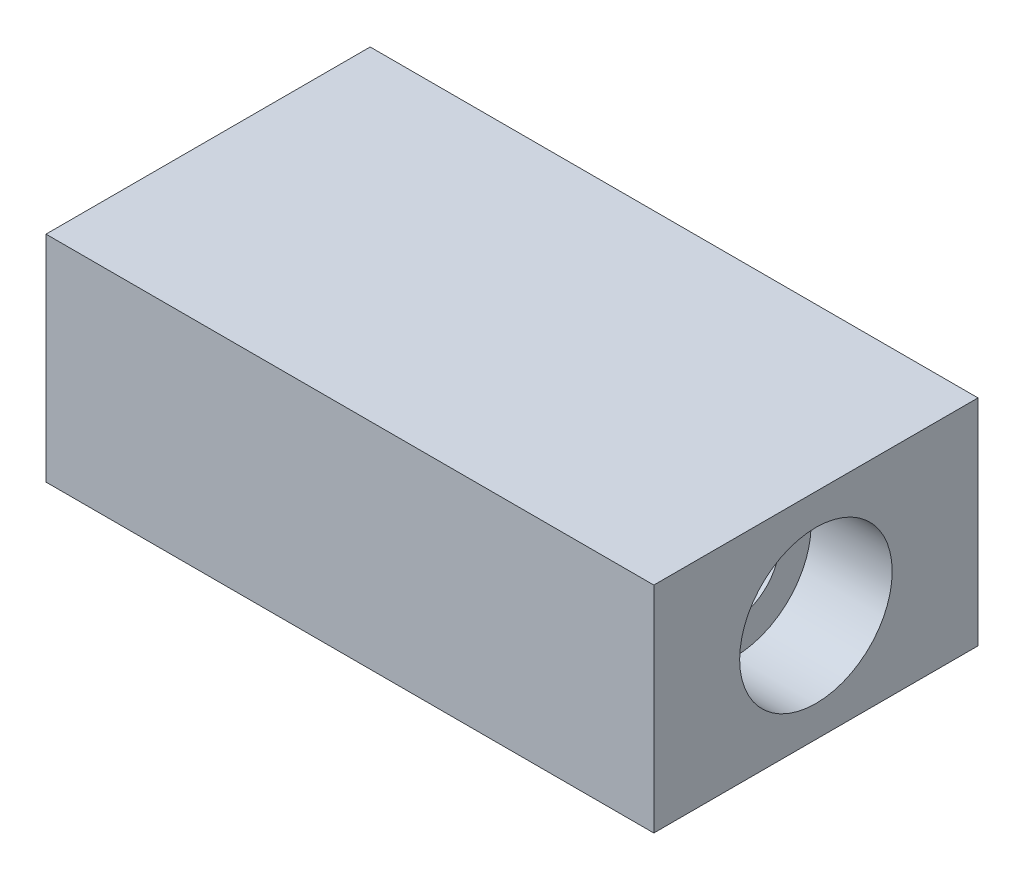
ISO-10303-21;
HEADER;
FILE_DESCRIPTION(('STEP AP214'),'2;1');
FILE_NAME('part.step','',(''),(''),'','','');
FILE_SCHEMA(('AUTOMOTIVE_DESIGN { 1 0 10303 214 1 1 1 1 }'));
ENDSEC;
DATA;
#1=APPLICATION_CONTEXT('core data for automotive mechanical design processes');
#2=APPLICATION_PROTOCOL_DEFINITION('international standard','automotive_design',2000,#1);
#3=PRODUCT_CONTEXT('',#1,'mechanical');
#4=PRODUCT('Part','Part','',(#3));
#5=PRODUCT_RELATED_PRODUCT_CATEGORY('part','',(#4));
#6=PRODUCT_DEFINITION_FORMATION('','',#4);
#7=PRODUCT_DEFINITION_CONTEXT('part definition',#1,'design');
#8=PRODUCT_DEFINITION('design','',#6,#7);
#9=PRODUCT_DEFINITION_SHAPE('','',#8);
#10=(LENGTH_UNIT() NAMED_UNIT(*) SI_UNIT(.MILLI.,.METRE.));
#11=(NAMED_UNIT(*) PLANE_ANGLE_UNIT() SI_UNIT($,.RADIAN.));
#12=(NAMED_UNIT(*) SI_UNIT($,.STERADIAN.) SOLID_ANGLE_UNIT());
#13=UNCERTAINTY_MEASURE_WITH_UNIT(LENGTH_MEASURE(1.E-05),#10,'distance_accuracy_value','');
#14=(GEOMETRIC_REPRESENTATION_CONTEXT(3) GLOBAL_UNCERTAINTY_ASSIGNED_CONTEXT((#13)) GLOBAL_UNIT_ASSIGNED_CONTEXT((#10,
#11,#12)) REPRESENTATION_CONTEXT('',''));
#15=CARTESIAN_POINT('',(0.,0.,0.));
#16=DIRECTION('',(0.,0.,1.));
#17=DIRECTION('',(1.,0.,0.));
#18=AXIS2_PLACEMENT_3D('',#15,#16,#17);
#19=CARTESIAN_POINT('',(75.,53.,40.));
#20=DIRECTION('',(-1.,0.,0.));
#21=DIRECTION('',(0.,0.,1.));
#22=AXIS2_PLACEMENT_3D('',#19,#20,#21);
#23=PLANE('',#22);
#24=CARTESIAN_POINT('',(75.,26.5,0.));
#25=DIRECTION('',(1.,0.,0.));
#26=DIRECTION('',(0.,0.,-1.));
#27=AXIS2_PLACEMENT_3D('',#24,#25,#26);
#28=CIRCLE('',#27,18.82);
#29=CARTESIAN_POINT('',(75.,26.5,-18.82));
#30=VERTEX_POINT('',#29);
#31=EDGE_CURVE('E98',#30,#30,#28,.T.);
#32=ORIENTED_EDGE('',*,*,#31,.F.);
#33=EDGE_LOOP('',(#32));
#34=FACE_BOUND('',#33,.T.);
#35=DIRECTION('',(0.,0.,-1.));
#36=VECTOR('',#35,1.);
#37=CARTESIAN_POINT('',(75.,0.,40.));
#38=LINE('',#37,#36);
#39=CARTESIAN_POINT('',(75.,0.,40.));
#40=VERTEX_POINT('',#39);
#41=CARTESIAN_POINT('',(75.,0.,-40.));
#42=VERTEX_POINT('',#41);
#43=EDGE_CURVE('E95',#40,#42,#38,.T.);
#44=ORIENTED_EDGE('',*,*,#43,.T.);
#45=DIRECTION('',(0.,-1.,0.));
#46=VECTOR('',#45,1.);
#47=CARTESIAN_POINT('',(75.,53.,-40.));
#48=LINE('',#47,#46);
#49=CARTESIAN_POINT('',(75.,53.,-40.));
#50=VERTEX_POINT('',#49);
#51=EDGE_CURVE('E11',#50,#42,#48,.T.);
#52=ORIENTED_EDGE('',*,*,#51,.F.);
#53=DIRECTION('',(0.,0.,-1.));
#54=VECTOR('',#53,1.);
#55=CARTESIAN_POINT('',(75.,53.,40.));
#56=LINE('',#55,#54);
#57=CARTESIAN_POINT('',(75.,53.,40.));
#58=VERTEX_POINT('',#57);
#59=EDGE_CURVE('E83',#58,#50,#56,.T.);
#60=ORIENTED_EDGE('',*,*,#59,.F.);
#61=DIRECTION('',(0.,-1.,0.));
#62=VECTOR('',#61,1.);
#63=CARTESIAN_POINT('',(75.,53.,40.));
#64=LINE('',#63,#62);
#65=EDGE_CURVE('E91',#58,#40,#64,.T.);
#66=ORIENTED_EDGE('',*,*,#65,.T.);
#67=EDGE_LOOP('',(#44,#52,#60,#66));
#68=FACE_BOUND('',#67,.T.);
#69=ADVANCED_FACE('F32',(#34,#68),#23,.F.);
#70=CARTESIAN_POINT('',(-75.,53.,-40.));
#71=DIRECTION('',(0.,0.,1.));
#72=DIRECTION('',(1.,0.,0.));
#73=AXIS2_PLACEMENT_3D('',#70,#71,#72);
#74=PLANE('',#73);
#75=DIRECTION('',(-1.,0.,0.));
#76=VECTOR('',#75,1.);
#77=CARTESIAN_POINT('',(-75.,0.,-40.));
#78=LINE('',#77,#76);
#79=CARTESIAN_POINT('',(-75.,0.,-40.));
#80=VERTEX_POINT('',#79);
#81=EDGE_CURVE('E87',#42,#80,#78,.T.);
#82=ORIENTED_EDGE('',*,*,#81,.T.);
#83=DIRECTION('',(0.,-1.,0.));
#84=VECTOR('',#83,1.);
#85=CARTESIAN_POINT('',(-75.,53.,-40.));
#86=LINE('',#85,#84);
#87=CARTESIAN_POINT('',(-75.,53.,-40.));
#88=VERTEX_POINT('',#87);
#89=EDGE_CURVE('E40',#88,#80,#86,.T.);
#90=ORIENTED_EDGE('',*,*,#89,.F.);
#91=DIRECTION('',(-1.,0.,0.));
#92=VECTOR('',#91,1.);
#93=CARTESIAN_POINT('',(-75.,53.,-40.));
#94=LINE('',#93,#92);
#95=EDGE_CURVE('E78',#50,#88,#94,.T.);
#96=ORIENTED_EDGE('',*,*,#95,.F.);
#97=ORIENTED_EDGE('',*,*,#51,.T.);
#98=EDGE_LOOP('',(#82,#90,#96,#97));
#99=FACE_BOUND('',#98,.T.);
#100=ADVANCED_FACE('F86',(#99),#74,.F.);
#101=CARTESIAN_POINT('',(-75.,53.,40.));
#102=DIRECTION('',(1.,0.,0.));
#103=DIRECTION('',(0.,0.,-1.));
#104=AXIS2_PLACEMENT_3D('',#101,#102,#103);
#105=PLANE('',#104);
#106=CARTESIAN_POINT('',(-75.,26.5,0.));
#107=DIRECTION('',(1.,0.,0.));
#108=DIRECTION('',(0.,0.,-1.));
#109=AXIS2_PLACEMENT_3D('',#106,#107,#108);
#110=CIRCLE('',#109,18.82);
#111=CARTESIAN_POINT('',(-75.,26.5,-18.82));
#112=VERTEX_POINT('',#111);
#113=EDGE_CURVE('E123',#112,#112,#110,.T.);
#114=ORIENTED_EDGE('',*,*,#113,.T.);
#115=EDGE_LOOP('',(#114));
#116=FACE_BOUND('',#115,.T.);
#117=DIRECTION('',(0.,0.,1.));
#118=VECTOR('',#117,1.);
#119=CARTESIAN_POINT('',(-75.,0.,40.));
#120=LINE('',#119,#118);
#121=CARTESIAN_POINT('',(-75.,0.,40.));
#122=VERTEX_POINT('',#121);
#123=EDGE_CURVE('E65',#80,#122,#120,.T.);
#124=ORIENTED_EDGE('',*,*,#123,.T.);
#125=DIRECTION('',(0.,-1.,0.));
#126=VECTOR('',#125,1.);
#127=CARTESIAN_POINT('',(-75.,53.,40.));
#128=LINE('',#127,#126);
#129=CARTESIAN_POINT('',(-75.,53.,40.));
#130=VERTEX_POINT('',#129);
#131=EDGE_CURVE('E88',#130,#122,#128,.T.);
#132=ORIENTED_EDGE('',*,*,#131,.F.);
#133=DIRECTION('',(0.,0.,1.));
#134=VECTOR('',#133,1.);
#135=CARTESIAN_POINT('',(-75.,53.,40.));
#136=LINE('',#135,#134);
#137=EDGE_CURVE('E81',#88,#130,#136,.T.);
#138=ORIENTED_EDGE('',*,*,#137,.F.);
#139=ORIENTED_EDGE('',*,*,#89,.T.);
#140=EDGE_LOOP('',(#124,#132,#138,#139));
#141=FACE_BOUND('',#140,.T.);
#142=ADVANCED_FACE('F89',(#116,#141),#105,.F.);
#143=CARTESIAN_POINT('',(-75.,53.,40.));
#144=DIRECTION('',(0.,0.,-1.));
#145=DIRECTION('',(-1.,0.,0.));
#146=AXIS2_PLACEMENT_3D('',#143,#144,#145);
#147=PLANE('',#146);
#148=DIRECTION('',(1.,0.,0.));
#149=VECTOR('',#148,1.);
#150=CARTESIAN_POINT('',(-75.,0.,40.));
#151=LINE('',#150,#149);
#152=EDGE_CURVE('E71',#122,#40,#151,.T.);
#153=ORIENTED_EDGE('',*,*,#152,.T.);
#154=ORIENTED_EDGE('',*,*,#65,.F.);
#155=DIRECTION('',(1.,0.,0.));
#156=VECTOR('',#155,1.);
#157=CARTESIAN_POINT('',(-75.,53.,40.));
#158=LINE('',#157,#156);
#159=EDGE_CURVE('E48',#130,#58,#158,.T.);
#160=ORIENTED_EDGE('',*,*,#159,.F.);
#161=ORIENTED_EDGE('',*,*,#131,.T.);
#162=EDGE_LOOP('',(#153,#154,#160,#161));
#163=FACE_BOUND('',#162,.T.);
#164=ADVANCED_FACE('F103',(#163),#147,.F.);
#165=CARTESIAN_POINT('',(0.,53.,0.));
#166=DIRECTION('',(0.,-1.,0.));
#167=DIRECTION('',(0.,0.,-1.));
#168=AXIS2_PLACEMENT_3D('',#165,#166,#167);
#169=PLANE('',#168);
#170=ORIENTED_EDGE('',*,*,#59,.T.);
#171=ORIENTED_EDGE('',*,*,#95,.T.);
#172=ORIENTED_EDGE('',*,*,#137,.T.);
#173=ORIENTED_EDGE('',*,*,#159,.T.);
#174=EDGE_LOOP('',(#170,#171,#172,#173));
#175=FACE_BOUND('',#174,.T.);
#176=ADVANCED_FACE('F79',(#175),#169,.F.);
#177=CARTESIAN_POINT('',(0.,0.,0.));
#178=DIRECTION('',(0.,-1.,0.));
#179=DIRECTION('',(0.,0.,-1.));
#180=AXIS2_PLACEMENT_3D('',#177,#178,#179);
#181=PLANE('',#180);
#182=ORIENTED_EDGE('',*,*,#43,.F.);
#183=ORIENTED_EDGE('',*,*,#152,.F.);
#184=ORIENTED_EDGE('',*,*,#123,.F.);
#185=ORIENTED_EDGE('',*,*,#81,.F.);
#186=EDGE_LOOP('',(#182,#183,#184,#185));
#187=FACE_BOUND('',#186,.T.);
#188=ADVANCED_FACE('F106',(#187),#181,.T.);
#189=CARTESIAN_POINT('',(75.,26.5,0.));
#190=DIRECTION('',(1.,0.,0.));
#191=DIRECTION('',(0.,0.,-1.));
#192=AXIS2_PLACEMENT_3D('',#189,#190,#191);
#193=CYLINDRICAL_SURFACE('',#192,18.82);
#194=CARTESIAN_POINT('',(55.,26.5,0.));
#195=DIRECTION('',(1.,0.,0.));
#196=DIRECTION('',(0.,0.,-1.));
#197=AXIS2_PLACEMENT_3D('',#194,#195,#196);
#198=CIRCLE('',#197,18.82);
#199=CARTESIAN_POINT('',(55.,26.5,-18.82));
#200=VERTEX_POINT('',#199);
#201=EDGE_CURVE('E111',#200,#200,#198,.T.);
#202=ORIENTED_EDGE('',*,*,#201,.F.);
#203=EDGE_LOOP('',(#202));
#204=FACE_BOUND('',#203,.T.);
#205=ORIENTED_EDGE('',*,*,#31,.T.);
#206=EDGE_LOOP('',(#205));
#207=FACE_BOUND('',#206,.T.);
#208=ADVANCED_FACE('F149',(#204,#207),#193,.F.);
#209=CARTESIAN_POINT('',(55.,37.5,0.));
#210=DIRECTION('',(-1.,0.,0.));
#211=DIRECTION('',(0.,0.,1.));
#212=AXIS2_PLACEMENT_3D('',#209,#210,#211);
#213=PLANE('',#212);
#214=CARTESIAN_POINT('',(55.,26.5,0.));
#215=DIRECTION('',(1.,0.,0.));
#216=DIRECTION('',(0.,0.,-1.));
#217=AXIS2_PLACEMENT_3D('',#214,#215,#216);
#218=CIRCLE('',#217,11.);
#219=CARTESIAN_POINT('',(55.,26.5,-11.));
#220=VERTEX_POINT('',#219);
#221=EDGE_CURVE('E114',#220,#220,#218,.T.);
#222=ORIENTED_EDGE('',*,*,#221,.F.);
#223=EDGE_LOOP('',(#222));
#224=FACE_BOUND('',#223,.T.);
#225=ORIENTED_EDGE('',*,*,#201,.T.);
#226=EDGE_LOOP('',(#225));
#227=FACE_BOUND('',#226,.T.);
#228=ADVANCED_FACE('F143',(#224,#227),#213,.F.);
#229=CARTESIAN_POINT('',(75.,26.5,0.));
#230=DIRECTION('',(1.,0.,0.));
#231=DIRECTION('',(0.,0.,-1.));
#232=AXIS2_PLACEMENT_3D('',#229,#230,#231);
#233=CYLINDRICAL_SURFACE('',#232,11.);
#234=CARTESIAN_POINT('',(-55.,26.5,0.));
#235=DIRECTION('',(1.,0.,0.));
#236=DIRECTION('',(0.,0.,-1.));
#237=AXIS2_PLACEMENT_3D('',#234,#235,#236);
#238=CIRCLE('',#237,11.);
#239=CARTESIAN_POINT('',(-55.,26.5,-11.));
#240=VERTEX_POINT('',#239);
#241=EDGE_CURVE('E117',#240,#240,#238,.T.);
#242=ORIENTED_EDGE('',*,*,#241,.F.);
#243=EDGE_LOOP('',(#242));
#244=FACE_BOUND('',#243,.T.);
#245=ORIENTED_EDGE('',*,*,#221,.T.);
#246=EDGE_LOOP('',(#245));
#247=FACE_BOUND('',#246,.T.);
#248=ADVANCED_FACE('F137',(#244,#247),#233,.F.);
#249=CARTESIAN_POINT('',(-55.,45.32,0.));
#250=DIRECTION('',(1.,0.,0.));
#251=DIRECTION('',(0.,0.,-1.));
#252=AXIS2_PLACEMENT_3D('',#249,#250,#251);
#253=PLANE('',#252);
#254=CARTESIAN_POINT('',(-55.,26.5,0.));
#255=DIRECTION('',(1.,0.,0.));
#256=DIRECTION('',(0.,0.,-1.));
#257=AXIS2_PLACEMENT_3D('',#254,#255,#256);
#258=CIRCLE('',#257,18.82);
#259=CARTESIAN_POINT('',(-55.,26.5,-18.82));
#260=VERTEX_POINT('',#259);
#261=EDGE_CURVE('E120',#260,#260,#258,.T.);
#262=ORIENTED_EDGE('',*,*,#261,.F.);
#263=EDGE_LOOP('',(#262));
#264=FACE_BOUND('',#263,.T.);
#265=ORIENTED_EDGE('',*,*,#241,.T.);
#266=EDGE_LOOP('',(#265));
#267=FACE_BOUND('',#266,.T.);
#268=ADVANCED_FACE('F131',(#264,#267),#253,.F.);
#269=CARTESIAN_POINT('',(75.,26.5,0.));
#270=DIRECTION('',(1.,0.,0.));
#271=DIRECTION('',(0.,0.,-1.));
#272=AXIS2_PLACEMENT_3D('',#269,#270,#271);
#273=CYLINDRICAL_SURFACE('',#272,18.82);
#274=ORIENTED_EDGE('',*,*,#113,.F.);
#275=EDGE_LOOP('',(#274));
#276=FACE_BOUND('',#275,.T.);
#277=ORIENTED_EDGE('',*,*,#261,.T.);
#278=EDGE_LOOP('',(#277));
#279=FACE_BOUND('',#278,.T.);
#280=ADVANCED_FACE('F128',(#276,#279),#273,.F.);
#281=CLOSED_SHELL('',(#69,#100,#142,#164,#176,#188,#208,#228,#248,#268,#280));
#282=MANIFOLD_SOLID_BREP('B2',#281);
#283=ADVANCED_BREP_SHAPE_REPRESENTATION('',(#18,#282),#14);
#284=SHAPE_DEFINITION_REPRESENTATION(#9,#283);
ENDSEC;
END-ISO-10303-21;
